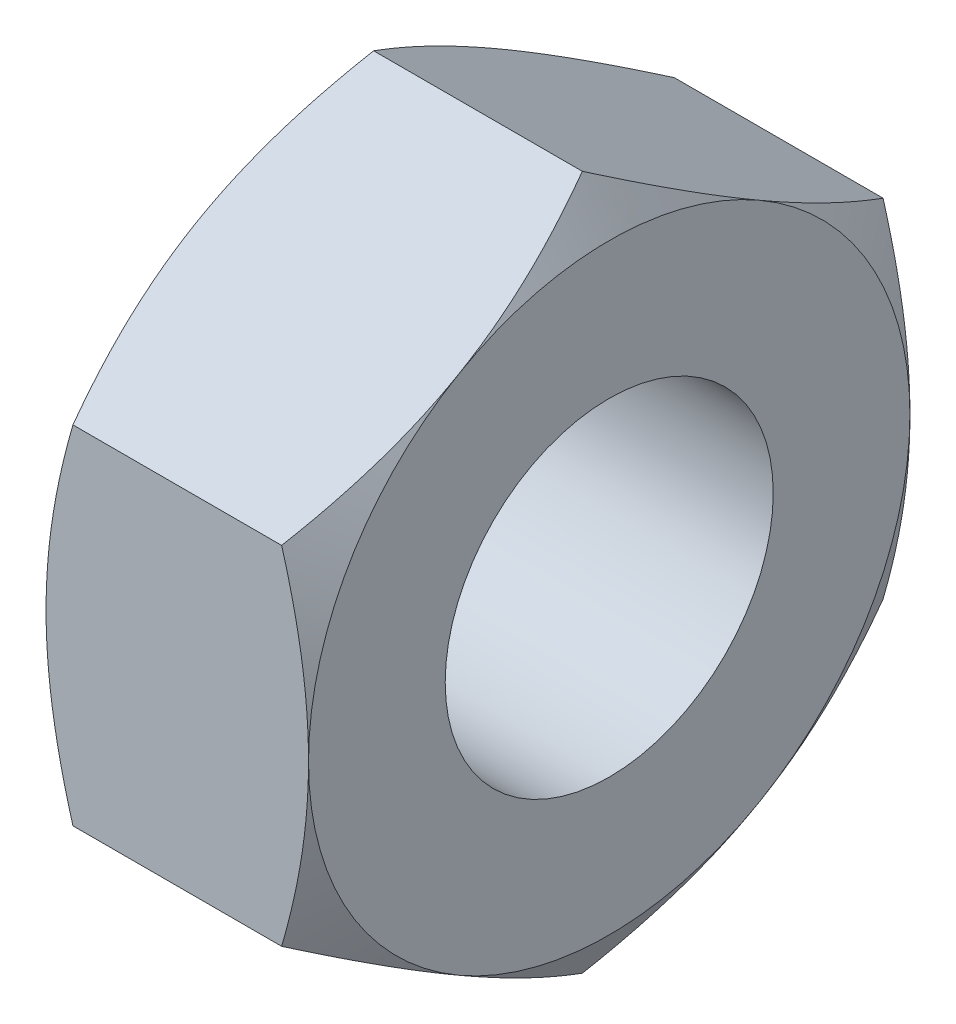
from build123d import *

# Parameters (mm, degrees)
ESQUISSE2_R             = 4.828460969
ENL_V_MAT_EXTRU_1_DEPTH = 8.237960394


with BuildPart() as part:
    # Esquisse1 → Base-R_volution (revolve)
    with BuildSketch(Plane.XY, mode=Mode.PRIVATE) as base_r_volution_sk:
        Polygon((-1.2, 1.5), (1.2, 1.5), (1.2, 2.75), (0, 4.828460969), (-1.2, 2.75), align=None)
    revolve(base_r_volution_sk.sketch.rotate(Axis((-20, 0, 0), (1, 0, 0)), 90), axis=Axis((-20, 0, 0), (1, 0, 0)))

    # Esquisse2 → Enl_v. mat.-Extru.1 (cut, through all)
    with BuildSketch(Plane(origin=(1.2, 0, 0), x_dir=(0, 0, -1), z_dir=(1, 0, 0))):
        Circle(ESQUISSE2_R)
        Polygon((2.75, -1.58771324), (2.75, 1.58771324), (0, 3.175426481), (-2.75, 1.58771324), (-2.75, -1.58771324), (0, -3.175426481), align=None, mode=Mode.SUBTRACT)
    extrude(amount=-ENL_V_MAT_EXTRU_1_DEPTH, mode=Mode.SUBTRACT)


solid = part.part
